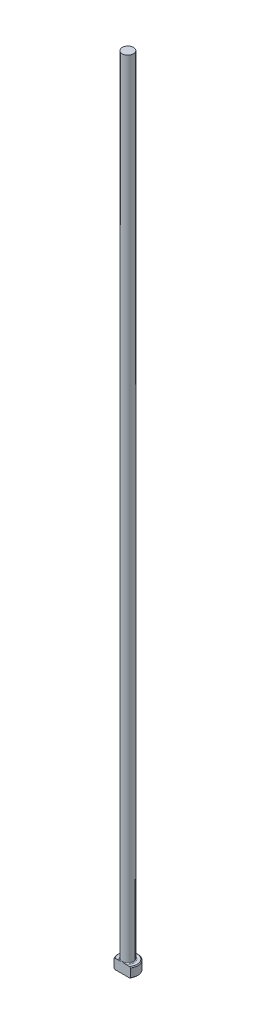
from build123d import *

# Parameters (mm, degrees)
CHAMFER1_SIZE = 0.254
FILLET1_R     = 0.254
KEY_DEPTH     = 255.0396844


with BuildPart() as part:
    # Sketch1 → Revolve1 (revolve)
    with BuildSketch(Plane.XY, mode=Mode.PRIVATE) as revolve1_sk:
        Polygon((0, 0), (-3.175, 0), (-3.175, 3.175), (-1.78562, 3.175), (-1.78562, 254), (0, 254), align=None)
    revolve(revolve1_sk.sketch.rotate(Axis((0, 259.958771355, 0), (0, -1, 0)), 270), axis=Axis((0, 259.958771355, 0), (0, -1, 0)))

    # Chamfer1
    chamfer1_edges = [part.edges().sort_by_distance(p)[0] for p in [
        (0, 3.175, -3.175),
        (0, 0, -3.175),
    ]]
    chamfer(chamfer1_edges, length=CHAMFER1_SIZE)

    # Fillet1
    fillet1_edges = [part.edges().sort_by_distance(p)[0] for p in [
        (0, 3.175, -1.78562),
    ]]
    fillet(fillet1_edges, radius=FILLET1_R)

    # Sketch2 → KEY (cut, through all)
    with BuildSketch(Plane.XZ):
        with BuildLine():
            Line((-2.625297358, 1.78562), (2.625297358, 1.78562))
            ThreePointArc((2.625297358, 1.78562), (0, 3.175), (-2.625297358, 1.78562))
        make_face()
    extrude(amount=-KEY_DEPTH, mode=Mode.SUBTRACT)


solid = part.part
